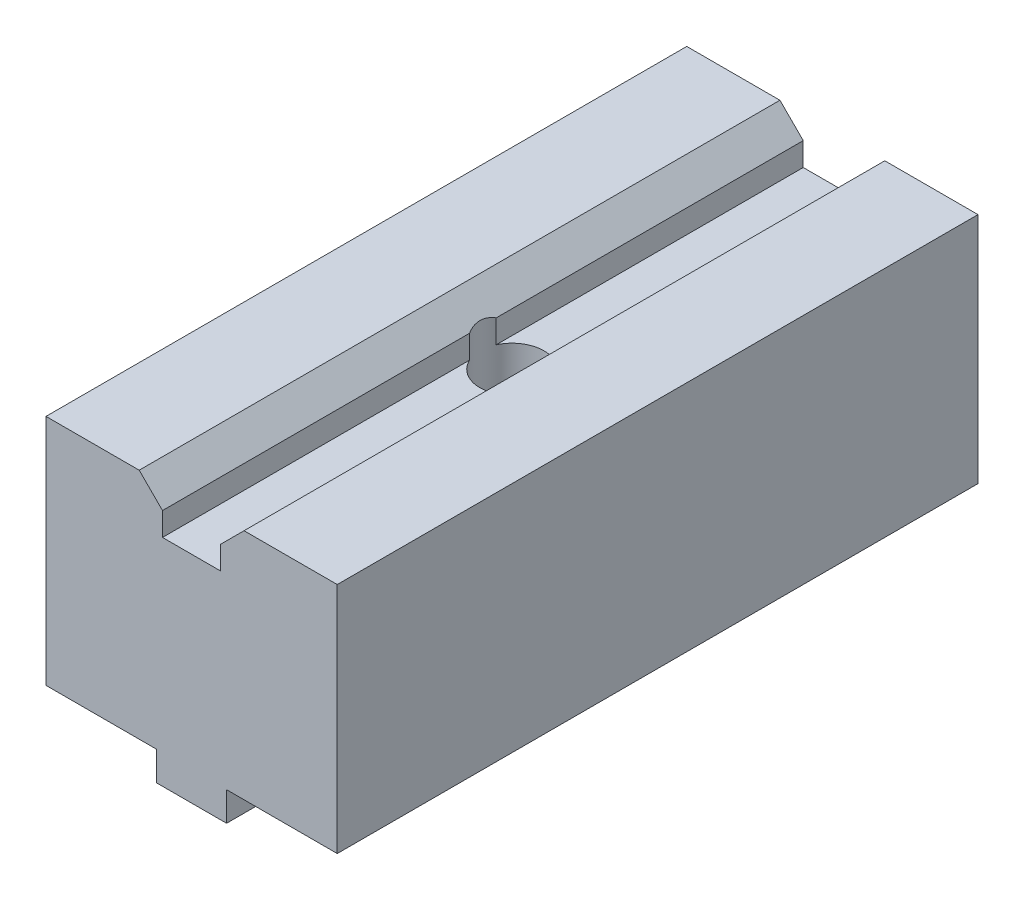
from build123d import *

# Parameters (mm, degrees)
AUFSATZ_LINEAR_AUSTRAGEN1_DEPTH                      = 27.5
SKIZZE5_W                                            = 6
SKIZZE5_H                                            = 2.5
AUFSATZ_LINEAR_AUSTRAGEN2_DEPTH                      = 55
STIRNSENKUNG_F_R_M2_5_ZYLINDERSCHRAUBE_M_D           = 2.9
STIRNSENKUNG_F_R_M2_5_ZYLINDERSCHRAUBE_M_CBORE_D     = 5.5
STIRNSENKUNG_F_R_M2_5_ZYLINDERSCHRAUBE_M_CBORE_DEPTH = 10


with BuildPart() as part:
    # Skizze1 → Aufsatz-Linear austragen1 (new, symmetric)
    with BuildSketch(Plane.XY):
        Polygon((12.5, 0), (-12.5, 0), (-12.5, 20), (-4.5, 20), (-2.5, 18), (-2.5, 16), (2.5, 16), (2.5, 18), (4.5, 20), (12.5, 20), align=None)
    extrude(amount=AUFSATZ_LINEAR_AUSTRAGEN1_DEPTH, both=True)

    # Skizze5 → Aufsatz-Linear austragen2 (add, through all)
    with BuildSketch(Plane.XY.offset(27.5)):
        with Locations((0, -1.25)):
            Rectangle(SKIZZE5_W, SKIZZE5_H)
    extrude(amount=-AUFSATZ_LINEAR_AUSTRAGEN2_DEPTH)

    # Stirnsenkung f_r M2.5 Zylinderschraube m (through all)
    with Locations(Plane(origin=(0, 20, 0), x_dir=(-1, 0, 0), z_dir=(0, 1, 0))):
        with Locations((0, 0)):
            CounterBoreHole(STIRNSENKUNG_F_R_M2_5_ZYLINDERSCHRAUBE_M_D / 2, STIRNSENKUNG_F_R_M2_5_ZYLINDERSCHRAUBE_M_CBORE_D / 2, STIRNSENKUNG_F_R_M2_5_ZYLINDERSCHRAUBE_M_CBORE_DEPTH)


solid = part.part
